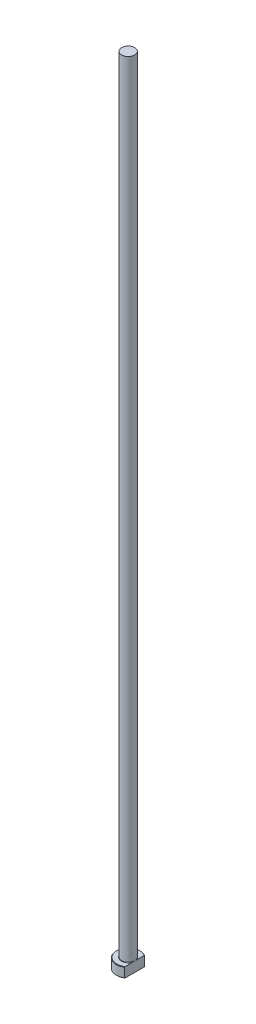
ISO-10303-21;
HEADER;
FILE_DESCRIPTION(('STEP AP214'),'2;1');
FILE_NAME('part.step','',(''),(''),'','','');
FILE_SCHEMA(('AUTOMOTIVE_DESIGN { 1 0 10303 214 1 1 1 1 }'));
ENDSEC;
DATA;
#1=APPLICATION_CONTEXT('core data for automotive mechanical design processes');
#2=APPLICATION_PROTOCOL_DEFINITION('international standard','automotive_design',2000,#1);
#3=PRODUCT_CONTEXT('',#1,'mechanical');
#4=PRODUCT('Part','Part','',(#3));
#5=PRODUCT_RELATED_PRODUCT_CATEGORY('part','',(#4));
#6=PRODUCT_DEFINITION_FORMATION('','',#4);
#7=PRODUCT_DEFINITION_CONTEXT('part definition',#1,'design');
#8=PRODUCT_DEFINITION('design','',#6,#7);
#9=PRODUCT_DEFINITION_SHAPE('','',#8);
#10=(LENGTH_UNIT() NAMED_UNIT(*) SI_UNIT(.MILLI.,.METRE.));
#11=(NAMED_UNIT(*) PLANE_ANGLE_UNIT() SI_UNIT($,.RADIAN.));
#12=(NAMED_UNIT(*) SI_UNIT($,.STERADIAN.) SOLID_ANGLE_UNIT());
#13=UNCERTAINTY_MEASURE_WITH_UNIT(LENGTH_MEASURE(1.E-05),#10,'distance_accuracy_value','');
#14=(GEOMETRIC_REPRESENTATION_CONTEXT(3) GLOBAL_UNCERTAINTY_ASSIGNED_CONTEXT((#13)) GLOBAL_UNIT_ASSIGNED_CONTEXT((#10,
#11,#12)) REPRESENTATION_CONTEXT('',''));
#15=CARTESIAN_POINT('',(0.,0.,0.));
#16=DIRECTION('',(0.,0.,1.));
#17=DIRECTION('',(1.,0.,0.));
#18=AXIS2_PLACEMENT_3D('',#15,#16,#17);
#19=CARTESIAN_POINT('',(0.,0.,0.));
#20=DIRECTION('',(0.,-1.,0.));
#21=DIRECTION('',(0.,0.,-1.));
#22=AXIS2_PLACEMENT_3D('',#19,#20,#21);
#23=PLANE('',#22);
#24=CARTESIAN_POINT('',(0.,0.,0.));
#25=DIRECTION('',(0.,-1.,0.));
#26=DIRECTION('',(0.,0.,-1.));
#27=AXIS2_PLACEMENT_3D('',#24,#25,#26);
#28=CIRCLE('',#27,5.79999999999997);
#29=CARTESIAN_POINT('',(3.24999999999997,0.,4.80390466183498));
#30=VERTEX_POINT('',#29);
#31=CARTESIAN_POINT('',(3.24999999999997,0.,-4.80390466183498));
#32=VERTEX_POINT('',#31);
#33=EDGE_CURVE('E98',#30,#32,#28,.T.);
#34=ORIENTED_EDGE('',*,*,#33,.T.);
#35=DIRECTION('',(0.,0.,1.));
#36=VECTOR('',#35,1.);
#37=CARTESIAN_POINT('',(3.24999999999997,0.,-5.04356025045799));
#38=LINE('',#37,#36);
#39=EDGE_CURVE('E83',#32,#30,#38,.T.);
#40=ORIENTED_EDGE('',*,*,#39,.T.);
#41=EDGE_LOOP('',(#34,#40));
#42=FACE_BOUND('',#41,.T.);
#43=ADVANCED_FACE('F32',(#42),#23,.T.);
#44=CARTESIAN_POINT('',(0.,259.958771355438,0.));
#45=DIRECTION('',(0.,1.,0.));
#46=DIRECTION('',(0.,0.,1.));
#47=AXIS2_PLACEMENT_3D('',#44,#45,#46);
#48=CYLINDRICAL_SURFACE('',#47,5.99999999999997);
#49=CARTESIAN_POINT('',(0.,4.80000000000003,0.));
#50=DIRECTION('',(0.,1.,0.));
#51=DIRECTION('',(0.,0.,1.));
#52=AXIS2_PLACEMENT_3D('',#49,#50,#51);
#53=CIRCLE('',#52,5.99999999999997);
#54=CARTESIAN_POINT('',(3.24999999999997,4.80000000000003,5.04356025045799));
#55=VERTEX_POINT('',#54);
#56=CARTESIAN_POINT('',(3.24999999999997,4.80000000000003,-5.04356025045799));
#57=VERTEX_POINT('',#56);
#58=EDGE_CURVE('E104',#55,#57,#53,.F.);
#59=ORIENTED_EDGE('',*,*,#58,.T.);
#60=DIRECTION('',(0.,-1.,0.));
#61=VECTOR('',#60,1.);
#62=CARTESIAN_POINT('',(3.24999999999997,400.,-5.04356025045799));
#63=LINE('',#62,#61);
#64=CARTESIAN_POINT('',(3.24999999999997,0.199999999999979,-5.04356025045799));
#65=VERTEX_POINT('',#64);
#66=EDGE_CURVE('E183',#57,#65,#63,.T.);
#67=ORIENTED_EDGE('',*,*,#66,.T.);
#68=CARTESIAN_POINT('',(0.,0.199999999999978,0.));
#69=DIRECTION('',(0.,-1.,0.));
#70=DIRECTION('',(0.,0.,-1.));
#71=AXIS2_PLACEMENT_3D('',#68,#69,#70);
#72=CIRCLE('',#71,5.99999999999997);
#73=CARTESIAN_POINT('',(3.24999999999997,0.199999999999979,5.04356025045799));
#74=VERTEX_POINT('',#73);
#75=EDGE_CURVE('E100',#65,#74,#72,.F.);
#76=ORIENTED_EDGE('',*,*,#75,.T.);
#77=DIRECTION('',(0.,-1.,0.));
#78=VECTOR('',#77,1.);
#79=CARTESIAN_POINT('',(3.24999999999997,400.,5.04356025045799));
#80=LINE('',#79,#78);
#81=EDGE_CURVE('E93',#55,#74,#80,.T.);
#82=ORIENTED_EDGE('',*,*,#81,.F.);
#83=EDGE_LOOP('',(#59,#67,#76,#82));
#84=FACE_BOUND('',#83,.T.);
#85=ADVANCED_FACE('F158',(#84),#48,.T.);
#86=CARTESIAN_POINT('',(-5.99999999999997,5.,0.));
#87=DIRECTION('',(0.,1.,0.));
#88=DIRECTION('',(0.,0.,1.));
#89=AXIS2_PLACEMENT_3D('',#86,#87,#88);
#90=PLANE('',#89);
#91=CARTESIAN_POINT('',(0.,5.,0.));
#92=DIRECTION('',(0.,1.,0.));
#93=DIRECTION('',(0.,0.,1.));
#94=AXIS2_PLACEMENT_3D('',#91,#92,#93);
#95=CIRCLE('',#94,5.79999999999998);
#96=CARTESIAN_POINT('',(3.24999999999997,5.,-4.80390466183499));
#97=VERTEX_POINT('',#96);
#98=CARTESIAN_POINT('',(3.24999999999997,5.,4.80390466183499));
#99=VERTEX_POINT('',#98);
#100=EDGE_CURVE('E178',#97,#99,#95,.T.);
#101=ORIENTED_EDGE('',*,*,#100,.T.);
#102=DIRECTION('',(0.,0.,-1.));
#103=VECTOR('',#102,1.);
#104=CARTESIAN_POINT('',(3.24999999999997,5.,0.));
#105=LINE('',#104,#103);
#106=CARTESIAN_POINT('',(3.24999999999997,4.99999999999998,1.15758369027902));
#107=VERTEX_POINT('',#106);
#108=EDGE_CURVE('E57',#99,#107,#105,.T.);
#109=ORIENTED_EDGE('',*,*,#108,.T.);
#110=CARTESIAN_POINT('',(0.,5.,0.));
#111=DIRECTION('',(0.,1.,0.));
#112=DIRECTION('',(0.,0.,1.));
#113=AXIS2_PLACEMENT_3D('',#110,#111,#112);
#114=CIRCLE('',#113,3.44999999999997);
#115=CARTESIAN_POINT('',(3.24999999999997,4.99999999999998,-1.15758369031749));
#116=VERTEX_POINT('',#115);
#117=EDGE_CURVE('E107',#107,#116,#114,.F.);
#118=ORIENTED_EDGE('',*,*,#117,.T.);
#119=EDGE_CURVE('E136',#116,#97,#105,.T.);
#120=ORIENTED_EDGE('',*,*,#119,.T.);
#121=EDGE_LOOP('',(#101,#109,#118,#120));
#122=FACE_BOUND('',#121,.T.);
#123=ADVANCED_FACE('F147',(#122),#90,.T.);
#124=CARTESIAN_POINT('',(0.,5.,0.));
#125=DIRECTION('',(0.,-1.,0.));
#126=DIRECTION('',(0.,0.,-1.));
#127=AXIS2_PLACEMENT_3D('',#124,#125,#126);
#128=CONICAL_SURFACE('',#127,5.79999999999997,0.785398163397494);
#129=ORIENTED_EDGE('',*,*,#58,.F.);
#130=CARTESIAN_POINT('',(3.24999999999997,-0.763340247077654,11.097222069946));
#131=CARTESIAN_POINT('',(3.24999999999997,-0.555249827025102,10.8803821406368));
#132=CARTESIAN_POINT('',(3.24999999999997,-0.347401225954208,10.6633095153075));
#133=CARTESIAN_POINT('',(3.24999999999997,0.0676973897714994,10.2285893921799));
#134=CARTESIAN_POINT('',(3.24999999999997,0.274947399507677,10.010941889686));
#135=CARTESIAN_POINT('',(3.24999999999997,0.68879015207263,9.5749031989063));
#136=CARTESIAN_POINT('',(3.24999999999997,0.895382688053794,9.35651181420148));
#137=CARTESIAN_POINT('',(3.24999999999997,1.30769007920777,8.91890298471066));
#138=CARTESIAN_POINT('',(3.24999999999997,1.51340493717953,8.69968554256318));
#139=CARTESIAN_POINT('',(3.24999999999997,1.92056067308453,8.26365159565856));
#140=CARTESIAN_POINT('',(3.24999999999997,2.1220182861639,8.04685072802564));
#141=CARTESIAN_POINT('',(3.24999999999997,2.52361432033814,7.61203089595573));
#142=CARTESIAN_POINT('',(3.24999999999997,2.72375274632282,7.39401193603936));
#143=CARTESIAN_POINT('',(3.24999999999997,3.1223203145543,6.95646589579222));
#144=CARTESIAN_POINT('',(3.24999999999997,3.32074966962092,6.73693900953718));
#145=CARTESIAN_POINT('',(3.24999999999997,3.71541049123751,6.2959206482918));
#146=CARTESIAN_POINT('',(3.24999999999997,3.91164199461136,6.07442920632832));
#147=CARTESIAN_POINT('',(3.24999999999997,4.26795525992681,5.66684646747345));
#148=CARTESIAN_POINT('',(3.24999999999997,4.42849662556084,5.48115751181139));
#149=CARTESIAN_POINT('',(3.24999999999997,4.74694681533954,5.10749706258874));
#150=CARTESIAN_POINT('',(3.24999999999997,4.9048553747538,4.91952534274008));
#151=CARTESIAN_POINT('',(3.24999999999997,5.21865243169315,4.53879767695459));
#152=CARTESIAN_POINT('',(3.24999999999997,5.37450606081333,4.34601291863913));
#153=CARTESIAN_POINT('',(3.24999999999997,5.68118935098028,3.95653844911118));
#154=CARTESIAN_POINT('',(3.24999999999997,5.83202036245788,3.75984981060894));
#155=CARTESIAN_POINT('',(3.24999999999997,6.05390638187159,3.4594085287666));
#156=CARTESIAN_POINT('',(3.24999999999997,6.12763821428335,3.35763377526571));
#157=CARTESIAN_POINT('',(3.24999999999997,6.27282302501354,3.15247478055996));
#158=CARTESIAN_POINT('',(3.24999999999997,6.3442761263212,3.04909062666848));
#159=CARTESIAN_POINT('',(3.24999999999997,6.48448981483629,2.84026816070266));
#160=CARTESIAN_POINT('',(3.24999999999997,6.55324599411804,2.7348268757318));
#161=CARTESIAN_POINT('',(3.24999999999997,6.68723865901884,2.52174014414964));
#162=CARTESIAN_POINT('',(3.24999999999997,6.75247550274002,2.4140949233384));
#163=CARTESIAN_POINT('',(3.24999999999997,6.87780644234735,2.19745654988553));
#164=CARTESIAN_POINT('',(3.24999999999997,6.93795082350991,2.08849289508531));
#165=CARTESIAN_POINT('',(3.24999999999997,7.05273719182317,1.86772106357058));
#166=CARTESIAN_POINT('',(3.24999999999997,7.10737807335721,1.75591232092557));
#167=CARTESIAN_POINT('',(3.24999999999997,7.26056715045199,1.41626442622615));
#168=CARTESIAN_POINT('',(3.24999999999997,7.34888232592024,1.1833811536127));
#169=CARTESIAN_POINT('',(3.24999999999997,7.44593218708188,0.835575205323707));
#170=CARTESIAN_POINT('',(3.24999999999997,7.4718222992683,0.725406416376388));
#171=CARTESIAN_POINT('',(3.24999999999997,7.51310579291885,0.5030789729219));
#172=CARTESIAN_POINT('',(3.24999999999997,7.52850034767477,0.390920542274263));
#173=CARTESIAN_POINT('',(3.24999999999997,7.54767882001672,0.166070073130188));
#174=CARTESIAN_POINT('',(3.24999999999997,7.5515109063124,0.0533822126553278));
#175=CARTESIAN_POINT('',(3.24999999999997,7.54741082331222,-0.171782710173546));
#176=CARTESIAN_POINT('',(3.24999999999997,7.5394779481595,-0.28425975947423));
#177=CARTESIAN_POINT('',(3.24999999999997,7.51253523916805,-0.507025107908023));
#178=CARTESIAN_POINT('',(3.24999999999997,7.4936058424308,-0.617323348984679));
#179=CARTESIAN_POINT('',(3.24999999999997,7.44595440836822,-0.835762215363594));
#180=CARTESIAN_POINT('',(3.24999999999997,7.41723093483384,-0.943902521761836));
#181=CARTESIAN_POINT('',(3.24999999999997,7.35127840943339,-1.15830231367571));
#182=CARTESIAN_POINT('',(3.24999999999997,7.31399439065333,-1.26454464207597));
#183=CARTESIAN_POINT('',(3.24999999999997,7.23254630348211,-1.47430332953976));
#184=CARTESIAN_POINT('',(3.24999999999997,7.18838353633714,-1.57782019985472));
#185=CARTESIAN_POINT('',(3.24999999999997,7.09672451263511,-1.7774238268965));
#186=CARTESIAN_POINT('',(3.24999999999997,7.04948595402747,-1.87363004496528));
#187=CARTESIAN_POINT('',(3.24999999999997,6.95089019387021,-2.06391775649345));
#188=CARTESIAN_POINT('',(3.24999999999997,6.89953216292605,-2.15799881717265));
#189=CARTESIAN_POINT('',(3.24999999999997,6.74036914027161,-2.43755985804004));
#190=CARTESIAN_POINT('',(3.24999999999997,6.62755752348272,-2.62018561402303));
#191=CARTESIAN_POINT('',(3.24999999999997,6.39256809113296,-2.98019331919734));
#192=CARTESIAN_POINT('',(3.24999999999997,6.27035601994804,-3.15755247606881));
#193=CARTESIAN_POINT('',(3.24999999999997,6.0197011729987,-3.50765833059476));
#194=CARTESIAN_POINT('',(3.24999999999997,5.8912614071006,-3.68040719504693));
#195=CARTESIAN_POINT('',(3.24999999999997,5.62829316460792,-4.02448614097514));
#196=CARTESIAN_POINT('',(3.24999999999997,5.49371006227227,-4.19577421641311));
#197=CARTESIAN_POINT('',(3.24999999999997,5.22110967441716,-4.5356145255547));
#198=CARTESIAN_POINT('',(3.24999999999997,5.08309204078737,-4.70416647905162));
#199=CARTESIAN_POINT('',(3.24999999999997,4.80478673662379,-5.03871726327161));
#200=CARTESIAN_POINT('',(3.24999999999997,4.66450509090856,-5.20472111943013));
#201=CARTESIAN_POINT('',(3.24999999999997,4.38193422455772,-5.53501285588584));
#202=CARTESIAN_POINT('',(3.24999999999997,4.23964496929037,-5.69930070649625));
#203=CARTESIAN_POINT('',(3.24999999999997,3.89726045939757,-6.09077577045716));
#204=CARTESIAN_POINT('',(3.24999999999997,3.69642117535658,-6.31731165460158));
#205=CARTESIAN_POINT('',(3.24999999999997,3.29246897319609,-6.76834962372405));
#206=CARTESIAN_POINT('',(3.24999999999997,3.08935601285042,-6.99285167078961));
#207=CARTESIAN_POINT('',(3.24999999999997,2.68122553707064,-7.44046009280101));
#208=CARTESIAN_POINT('',(3.24999999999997,2.47620657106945,-7.66356514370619));
#209=CARTESIAN_POINT('',(3.24999999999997,2.06481442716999,-8.10852300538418));
#210=CARTESIAN_POINT('',(3.24999999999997,1.85844124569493,-8.33037581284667));
#211=CARTESIAN_POINT('',(3.24999999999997,1.45176082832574,-8.76543407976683));
#212=CARTESIAN_POINT('',(3.24999999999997,1.25149010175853,-8.9786736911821));
#213=CARTESIAN_POINT('',(3.24999999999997,0.850131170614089,-9.40438299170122));
#214=CARTESIAN_POINT('',(3.24999999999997,0.649042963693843,-9.61685267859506));
#215=CARTESIAN_POINT('',(3.24999999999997,0.246391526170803,-10.0409455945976));
#216=CARTESIAN_POINT('',(3.24999999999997,0.0448289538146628,-10.2525694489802));
#217=CARTESIAN_POINT('',(3.24999999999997,-0.358859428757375,-10.6752763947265));
#218=CARTESIAN_POINT('',(3.24999999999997,-0.560985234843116,-10.8863594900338));
#219=CARTESIAN_POINT('',(3.24999999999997,-0.763340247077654,-11.097222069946));
#220=B_SPLINE_CURVE_WITH_KNOTS('',3,(#130,#131,#132,#133,#134,#135,#136,#137,#138,#139,#140,
#141,#142,#143,#144,#145,#146,#147,#148,#149,#150,#151,#152,#153,#154,#155,#156,#157,#158,#159,
#160,#161,#162,#163,#164,#165,#166,#167,#168,#169,#170,#171,#172,#173,#174,#175,#176,#177,#178,
#179,#180,#181,#182,#183,#184,#185,#186,#187,#188,#189,#190,#191,#192,#193,#194,#195,#196,#197,
#198,#199,#200,#201,#202,#203,#204,#205,#206,#207,#208,#209,#210,#211,#212,#213,#214,#215,#216,
#217,#218,#219),.UNSPECIFIED.,.F.,.F.,(4,2,2,2,2,2,2,2,2,2,2,2,2,2,2,2,2,2,2,2,2,2,2,2,2,2,2,2,
2,2,2,2,2,2,2,2,2,2,2,2,2,2,2,2,4),(0.,0.901604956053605,1.80321729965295,2.70508973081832,
3.60695928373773,4.49481204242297,5.3826615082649,6.27039876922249,7.15812113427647,
7.89450333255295,8.63095913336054,9.37461869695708,10.1180766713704,10.4950808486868,
10.8720646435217,11.2496408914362,11.6271786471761,12.0003984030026,12.3736929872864,
13.117405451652,13.4565058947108,13.795568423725,14.1332164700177,14.4708847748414,
14.8061136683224,15.1413917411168,15.4788860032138,15.8163164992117,16.1377318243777,
16.4592120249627,17.1027431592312,17.7487418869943,18.3944314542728,19.0478814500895,
19.7013979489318,20.3533948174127,21.0054029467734,21.9136176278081,22.8218492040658,
23.7308402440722,24.6398336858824,25.5174503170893,26.3950694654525,27.2718289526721,
28.1485820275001),.UNSPECIFIED.);
#221=EDGE_CURVE('E135',#55,#99,#220,.T.);
#222=ORIENTED_EDGE('',*,*,#221,.T.);
#223=ORIENTED_EDGE('',*,*,#100,.F.);
#224=EDGE_CURVE('E127',#97,#57,#220,.T.);
#225=ORIENTED_EDGE('',*,*,#224,.T.);
#226=EDGE_LOOP('',(#129,#222,#223,#225));
#227=FACE_BOUND('',#226,.T.);
#228=ADVANCED_FACE('F143',(#227),#128,.T.);
#229=CARTESIAN_POINT('',(0.,0.199999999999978,0.));
#230=DIRECTION('',(0.,1.,0.));
#231=DIRECTION('',(0.,0.,1.));
#232=AXIS2_PLACEMENT_3D('',#229,#230,#231);
#233=CONICAL_SURFACE('',#232,5.99999999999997,0.785398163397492);
#234=ORIENTED_EDGE('',*,*,#75,.F.);
#235=CARTESIAN_POINT('',(3.24999999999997,5.76334024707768,-11.097222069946));
#236=CARTESIAN_POINT('',(3.24999999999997,5.55524982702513,-10.8803821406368));
#237=CARTESIAN_POINT('',(3.24999999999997,5.34740122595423,-10.6633095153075));
#238=CARTESIAN_POINT('',(3.24999999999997,4.93230261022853,-10.2285893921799));
#239=CARTESIAN_POINT('',(3.24999999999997,4.72505260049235,-10.010941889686));
#240=CARTESIAN_POINT('',(3.24999999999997,4.31120984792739,-9.5749031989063));
#241=CARTESIAN_POINT('',(3.24999999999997,4.10461731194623,-9.35651181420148));
#242=CARTESIAN_POINT('',(3.24999999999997,3.69230992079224,-8.91890298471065));
#243=CARTESIAN_POINT('',(3.24999999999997,3.48659506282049,-8.69968554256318));
#244=CARTESIAN_POINT('',(3.24999999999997,3.07943932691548,-8.26365159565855));
#245=CARTESIAN_POINT('',(3.24999999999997,2.87798171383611,-8.04685072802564));
#246=CARTESIAN_POINT('',(3.24999999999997,2.47638567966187,-7.61203089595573));
#247=CARTESIAN_POINT('',(3.24999999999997,2.27624725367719,-7.39401193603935));
#248=CARTESIAN_POINT('',(3.24999999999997,1.87767968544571,-6.95646589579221));
#249=CARTESIAN_POINT('',(3.24999999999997,1.67925033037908,-6.73693900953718));
#250=CARTESIAN_POINT('',(3.24999999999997,1.28458950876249,-6.29592064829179));
#251=CARTESIAN_POINT('',(3.24999999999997,1.08835800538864,-6.07442920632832));
#252=CARTESIAN_POINT('',(3.24999999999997,0.732044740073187,-5.66684646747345));
#253=CARTESIAN_POINT('',(3.24999999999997,0.571503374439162,-5.48115751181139));
#254=CARTESIAN_POINT('',(3.24999999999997,0.25305318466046,-5.10749706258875));
#255=CARTESIAN_POINT('',(3.24999999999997,0.0951446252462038,-4.91952534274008));
#256=CARTESIAN_POINT('',(3.24999999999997,-0.218652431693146,-4.5387976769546));
#257=CARTESIAN_POINT('',(3.24999999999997,-0.374506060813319,-4.34601291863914));
#258=CARTESIAN_POINT('',(3.24999999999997,-0.681189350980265,-3.9565384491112));
#259=CARTESIAN_POINT('',(3.24999999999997,-0.832020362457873,-3.75984981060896));
#260=CARTESIAN_POINT('',(3.24999999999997,-1.05390638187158,-3.45940852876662));
#261=CARTESIAN_POINT('',(3.24999999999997,-1.12763821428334,-3.35763377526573));
#262=CARTESIAN_POINT('',(3.24999999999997,-1.27282302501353,-3.15247478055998));
#263=CARTESIAN_POINT('',(3.24999999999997,-1.34427612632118,-3.04909062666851));
#264=CARTESIAN_POINT('',(3.24999999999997,-1.48448981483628,-2.84026816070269));
#265=CARTESIAN_POINT('',(3.24999999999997,-1.55324599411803,-2.73482687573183));
#266=CARTESIAN_POINT('',(3.24999999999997,-1.68723865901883,-2.52174014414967));
#267=CARTESIAN_POINT('',(3.24999999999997,-1.75247550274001,-2.41409492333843));
#268=CARTESIAN_POINT('',(3.24999999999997,-1.87780644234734,-2.19745654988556));
#269=CARTESIAN_POINT('',(3.24999999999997,-1.93795082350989,-2.08849289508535));
#270=CARTESIAN_POINT('',(3.24999999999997,-2.05273719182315,-1.86772106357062));
#271=CARTESIAN_POINT('',(3.24999999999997,-2.10737807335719,-1.75591232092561));
#272=CARTESIAN_POINT('',(3.24999999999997,-2.26056715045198,-1.4162644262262));
#273=CARTESIAN_POINT('',(3.24999999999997,-2.34888232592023,-1.18338115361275));
#274=CARTESIAN_POINT('',(3.24999999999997,-2.44593218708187,-0.83557520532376));
#275=CARTESIAN_POINT('',(3.24999999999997,-2.4718222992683,-0.725406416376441));
#276=CARTESIAN_POINT('',(3.24999999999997,-2.51310579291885,-0.503078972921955));
#277=CARTESIAN_POINT('',(3.24999999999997,-2.52850034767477,-0.390920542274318));
#278=CARTESIAN_POINT('',(3.24999999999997,-2.54767882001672,-0.166070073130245));
#279=CARTESIAN_POINT('',(3.24999999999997,-2.5515109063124,-0.0533822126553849));
#280=CARTESIAN_POINT('',(3.24999999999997,-2.54741082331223,0.171782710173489));
#281=CARTESIAN_POINT('',(3.24999999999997,-2.53947794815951,0.284259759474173));
#282=CARTESIAN_POINT('',(3.24999999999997,-2.51253523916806,0.507025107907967));
#283=CARTESIAN_POINT('',(3.24999999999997,-2.49360584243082,0.617323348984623));
#284=CARTESIAN_POINT('',(3.24999999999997,-2.44595440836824,0.83576221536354));
#285=CARTESIAN_POINT('',(3.24999999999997,-2.41723093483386,0.943902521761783));
#286=CARTESIAN_POINT('',(3.24999999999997,-2.35127840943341,1.15830231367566));
#287=CARTESIAN_POINT('',(3.24999999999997,-2.31399439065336,1.26454464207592));
#288=CARTESIAN_POINT('',(3.24999999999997,-2.23254630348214,1.47430332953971));
#289=CARTESIAN_POINT('',(3.24999999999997,-2.18838353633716,1.57782019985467));
#290=CARTESIAN_POINT('',(3.24999999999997,-2.09672451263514,1.77742382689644));
#291=CARTESIAN_POINT('',(3.24999999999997,-2.04948595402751,1.87363004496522));
#292=CARTESIAN_POINT('',(3.24999999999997,-1.95089019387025,2.06391775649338));
#293=CARTESIAN_POINT('',(3.24999999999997,-1.8995321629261,2.15799881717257));
#294=CARTESIAN_POINT('',(3.24999999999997,-1.74036914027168,2.43755985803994));
#295=CARTESIAN_POINT('',(3.24999999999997,-1.6275575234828,2.62018561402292));
#296=CARTESIAN_POINT('',(3.24999999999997,-1.39256809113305,2.98019331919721));
#297=CARTESIAN_POINT('',(3.24999999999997,-1.27035601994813,3.15755247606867));
#298=CARTESIAN_POINT('',(3.24999999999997,-1.01970117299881,3.5076583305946));
#299=CARTESIAN_POINT('',(3.24999999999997,-0.891261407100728,3.68040719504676));
#300=CARTESIAN_POINT('',(3.24999999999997,-0.628293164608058,4.02448614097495));
#301=CARTESIAN_POINT('',(3.24999999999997,-0.493710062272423,4.19577421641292));
#302=CARTESIAN_POINT('',(3.24999999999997,-0.221109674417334,4.53561452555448));
#303=CARTESIAN_POINT('',(3.24999999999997,-0.0830920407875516,4.7041664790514));
#304=CARTESIAN_POINT('',(3.24999999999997,0.195213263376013,5.03871726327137));
#305=CARTESIAN_POINT('',(3.24999999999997,0.335494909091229,5.20472111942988));
#306=CARTESIAN_POINT('',(3.24999999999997,0.618065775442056,5.53501285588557));
#307=CARTESIAN_POINT('',(3.24999999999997,0.760355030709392,5.69930070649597));
#308=CARTESIAN_POINT('',(3.24999999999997,1.10273954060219,6.09077577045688));
#309=CARTESIAN_POINT('',(3.24999999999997,1.30357882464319,6.31731165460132));
#310=CARTESIAN_POINT('',(3.24999999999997,1.70753102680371,6.76834962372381));
#311=CARTESIAN_POINT('',(3.24999999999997,1.91064398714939,6.99285167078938));
#312=CARTESIAN_POINT('',(3.24999999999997,2.3187744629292,7.44046009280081));
#313=CARTESIAN_POINT('',(3.24999999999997,2.52379342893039,7.66356514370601));
#314=CARTESIAN_POINT('',(3.24999999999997,2.93518557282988,8.10852300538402));
#315=CARTESIAN_POINT('',(3.24999999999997,3.14155875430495,8.33037581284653));
#316=CARTESIAN_POINT('',(3.24999999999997,3.54823917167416,8.7654340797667));
#317=CARTESIAN_POINT('',(3.24999999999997,3.74850989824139,8.97867369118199));
#318=CARTESIAN_POINT('',(3.24999999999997,4.14986882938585,9.40438299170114));
#319=CARTESIAN_POINT('',(3.24999999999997,4.3509570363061,9.61685267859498));
#320=CARTESIAN_POINT('',(3.24999999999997,4.75360847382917,10.0409455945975));
#321=CARTESIAN_POINT('',(3.24999999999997,4.95517104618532,10.2525694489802));
#322=CARTESIAN_POINT('',(3.24999999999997,5.35885942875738,10.6752763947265));
#323=CARTESIAN_POINT('',(3.24999999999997,5.56098523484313,10.8863594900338));
#324=CARTESIAN_POINT('',(3.24999999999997,5.76334024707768,11.097222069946));
#325=B_SPLINE_CURVE_WITH_KNOTS('',3,(#235,#236,#237,#238,#239,#240,#241,#242,#243,#244,#245,
#246,#247,#248,#249,#250,#251,#252,#253,#254,#255,#256,#257,#258,#259,#260,#261,#262,#263,#264,
#265,#266,#267,#268,#269,#270,#271,#272,#273,#274,#275,#276,#277,#278,#279,#280,#281,#282,#283,
#284,#285,#286,#287,#288,#289,#290,#291,#292,#293,#294,#295,#296,#297,#298,#299,#300,#301,#302,
#303,#304,#305,#306,#307,#308,#309,#310,#311,#312,#313,#314,#315,#316,#317,#318,#319,#320,#321,
#322,#323,#324),.UNSPECIFIED.,.F.,.F.,(4,2,2,2,2,2,2,2,2,2,2,2,2,2,2,2,2,2,2,2,2,2,2,2,2,2,2,2,
2,2,2,2,2,2,2,2,2,2,2,2,2,2,2,2,4),(0.,0.901604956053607,1.80321729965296,2.70508973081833,
3.60695928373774,4.49481204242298,5.38266150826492,6.27039876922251,7.15812113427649,
7.89450333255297,8.63095913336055,9.37461869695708,10.1180766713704,10.4950808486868,
10.8720646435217,11.2496408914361,11.6271786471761,12.0003984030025,12.3736929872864,
13.117405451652,13.4565058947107,13.795568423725,14.1332164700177,14.4708847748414,
14.8061136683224,15.1413917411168,15.4788860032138,15.8163164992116,16.1377318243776,
16.4592120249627,17.1027431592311,17.7487418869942,18.3944314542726,19.0478814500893,
19.7013979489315,20.3533948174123,21.0054029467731,21.9136176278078,22.8218492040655,
23.730840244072,24.6398336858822,25.5174503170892,26.3950694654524,27.2718289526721,
28.1485820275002),.UNSPECIFIED.);
#326=EDGE_CURVE('E86',#65,#32,#325,.T.);
#327=ORIENTED_EDGE('',*,*,#326,.T.);
#328=ORIENTED_EDGE('',*,*,#33,.F.);
#329=EDGE_CURVE('E89',#30,#74,#325,.T.);
#330=ORIENTED_EDGE('',*,*,#329,.T.);
#331=EDGE_LOOP('',(#234,#327,#328,#330));
#332=FACE_BOUND('',#331,.T.);
#333=ADVANCED_FACE('F97',(#332),#233,.T.);
#334=CARTESIAN_POINT('',(0.,5.19999999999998,0.));
#335=DIRECTION('',(0.,1.,0.));
#336=DIRECTION('',(0.,0.,1.));
#337=AXIS2_PLACEMENT_3D('',#334,#335,#336);
#338=TOROIDAL_SURFACE('',#337,3.44999999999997,0.2);
#339=CARTESIAN_POINT('',(3.24999999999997,5.19999999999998,0.));
#340=CARTESIAN_POINT('',(3.24999999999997,5.20000050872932,1.30593484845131E-10));
#341=CARTESIAN_POINT('',(3.24999999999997,5.20000101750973,-2.02989018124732E-07));
#342=CARTESIAN_POINT('',(3.24999999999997,5.20000196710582,-7.62846146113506E-07));
#343=CARTESIAN_POINT('',(3.24999999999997,5.20000239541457,-1.13332165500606E-06));
#344=CARTESIAN_POINT('',(3.24999999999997,5.20000328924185,-2.02149564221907E-06));
#345=CARTESIAN_POINT('',(3.24999999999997,5.20000374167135,-2.55359112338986E-06));
#346=CARTESIAN_POINT('',(3.24999999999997,5.20000454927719,-3.65434903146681E-06));
#347=CARTESIAN_POINT('',(3.24999999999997,5.20000490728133,-4.22110424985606E-06));
#348=CARTESIAN_POINT('',(3.24999999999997,5.20000624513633,-6.42540895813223E-06));
#349=CARTESIAN_POINT('',(3.24999999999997,5.20000715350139,-8.1091236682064E-06));
#350=CARTESIAN_POINT('',(3.24999999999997,5.20000863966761,-1.14364149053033E-05));
#351=CARTESIAN_POINT('',(3.24999999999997,5.20000923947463,-1.30705587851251E-05));
#352=CARTESIAN_POINT('',(3.24999999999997,5.20001177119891,-2.00139280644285E-05));
#353=CARTESIAN_POINT('',(3.24999999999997,5.20001367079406,-2.53379428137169E-05));
#354=CARTESIAN_POINT('',(3.24999999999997,5.20001645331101,-3.53765138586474E-05));
#355=CARTESIAN_POINT('',(3.24999999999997,5.20001744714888,-4.00600779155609E-05));
#356=CARTESIAN_POINT('',(3.24999999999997,5.20002471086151,-7.49504389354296E-05));
#357=CARTESIAN_POINT('',(3.24999999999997,5.20003024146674,-0.00010526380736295));
#358=CARTESIAN_POINT('',(3.24999999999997,5.20005445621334,-0.00022532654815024));
#359=CARTESIAN_POINT('',(3.24999999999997,5.20007753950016,-0.000314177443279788));
#360=CARTESIAN_POINT('',(3.24999999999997,5.20016768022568,-0.000666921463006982));
#361=CARTESIAN_POINT('',(3.24999999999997,5.20023191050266,-0.000931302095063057));
#362=CARTESIAN_POINT('',(3.24999999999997,5.20048969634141,-0.00198463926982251));
#363=CARTESIAN_POINT('',(3.24999999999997,5.20068683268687,-0.0027729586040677));
#364=CARTESIAN_POINT('',(3.24999999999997,5.20150726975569,-0.00606245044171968));
#365=CARTESIAN_POINT('',(3.24999999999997,5.20212605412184,-0.00856442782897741));
#366=CARTESIAN_POINT('',(3.24999999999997,5.20719838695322,-0.0290628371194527));
#367=CARTESIAN_POINT('',(3.24999999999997,5.21166800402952,-0.0470565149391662));
#368=CARTESIAN_POINT('',(3.24999999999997,5.22040162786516,-0.0823313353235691));
#369=CARTESIAN_POINT('',(3.24999999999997,5.22466671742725,-0.0996122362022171));
#370=CARTESIAN_POINT('',(3.24999999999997,5.23855308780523,-0.156076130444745));
#371=CARTESIAN_POINT('',(3.24999999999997,5.24811538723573,-0.195273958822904));
#372=CARTESIAN_POINT('',(3.24999999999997,5.26421029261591,-0.262424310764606));
#373=CARTESIAN_POINT('',(3.24999999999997,5.27082096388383,-0.290358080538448));
#374=CARTESIAN_POINT('',(3.24999999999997,5.28365202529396,-0.345539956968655));
#375=CARTESIAN_POINT('',(3.24999999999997,5.28987810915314,-0.3727867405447));
#376=CARTESIAN_POINT('',(3.24999999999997,5.30721519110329,-0.45039737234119));
#377=CARTESIAN_POINT('',(3.24999999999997,5.31800675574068,-0.500833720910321));
#378=CARTESIAN_POINT('',(3.24999999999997,5.33836987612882,-0.60242326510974));
#379=CARTESIAN_POINT('',(3.24999999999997,5.34792968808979,-0.653578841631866));
#380=CARTESIAN_POINT('',(3.24999999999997,5.36597954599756,-0.760718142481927));
#381=CARTESIAN_POINT('',(3.24999999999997,5.37430170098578,-0.81673101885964));
#382=CARTESIAN_POINT('',(3.24999999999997,5.38793579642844,-0.928977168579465));
#383=CARTESIAN_POINT('',(3.24999999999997,5.39325594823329,-0.985209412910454));
#384=CARTESIAN_POINT('',(3.24999999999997,5.39967715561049,-1.09627192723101));
#385=CARTESIAN_POINT('',(3.24999999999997,5.40090002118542,-1.15109363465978));
#386=CARTESIAN_POINT('',(3.24999999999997,5.39854105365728,-1.23278196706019));
#387=CARTESIAN_POINT('',(3.24999999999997,5.397083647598,-1.25970835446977));
#388=CARTESIAN_POINT('',(3.24999999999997,5.39248016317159,-1.31340846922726));
#389=CARTESIAN_POINT('',(3.24999999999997,5.38933527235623,-1.34018229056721));
#390=CARTESIAN_POINT('',(3.24999999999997,5.38085808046,-1.39365539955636));
#391=CARTESIAN_POINT('',(3.24999999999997,5.37550486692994,-1.42035144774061));
#392=CARTESIAN_POINT('',(3.24999999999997,5.36186683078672,-1.47304562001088));
#393=CARTESIAN_POINT('',(3.24999999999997,5.35358306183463,-1.49904399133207));
#394=CARTESIAN_POINT('',(3.24999999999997,5.33840624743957,-1.53566403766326));
#395=CARTESIAN_POINT('',(3.24999999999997,5.33319528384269,-1.54697847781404));
#396=CARTESIAN_POINT('',(3.24999999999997,5.32165705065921,-1.56904809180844));
#397=CARTESIAN_POINT('',(3.24999999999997,5.31532920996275,-1.57980297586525));
#398=CARTESIAN_POINT('',(3.24999999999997,5.30232638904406,-1.5988624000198));
#399=CARTESIAN_POINT('',(3.24999999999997,5.2958406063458,-1.60729427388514));
#400=CARTESIAN_POINT('',(3.24999999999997,5.28165581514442,-1.62307272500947));
#401=CARTESIAN_POINT('',(3.24999999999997,5.2739607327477,-1.63042267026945));
#402=CARTESIAN_POINT('',(3.24999999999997,5.26066720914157,-1.64067803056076));
#403=CARTESIAN_POINT('',(3.24999999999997,5.25551950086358,-1.64416379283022));
#404=CARTESIAN_POINT('',(3.24999999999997,5.24475577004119,-1.65032852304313));
#405=CARTESIAN_POINT('',(3.24999999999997,5.23914006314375,-1.65300802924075));
#406=CARTESIAN_POINT('',(3.24999999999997,5.22744494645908,-1.65736207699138));
#407=CARTESIAN_POINT('',(3.24999999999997,5.22136079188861,-1.65902420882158));
#408=CARTESIAN_POINT('',(3.24999999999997,5.20898349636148,-1.66109219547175));
#409=CARTESIAN_POINT('',(3.24999999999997,5.20269065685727,-1.66149978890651));
#410=CARTESIAN_POINT('',(3.24999999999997,5.19107570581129,-1.66104520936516));
#411=CARTESIAN_POINT('',(3.24999999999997,5.18574582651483,-1.66035949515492));
#412=CARTESIAN_POINT('',(3.24999999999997,5.17527668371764,-1.65810570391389));
#413=CARTESIAN_POINT('',(3.24999999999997,5.1701375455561,-1.65653705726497));
#414=CARTESIAN_POINT('',(3.24999999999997,5.15872192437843,-1.65208432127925));
#415=CARTESIAN_POINT('',(3.24999999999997,5.15254320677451,-1.64895170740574));
#416=CARTESIAN_POINT('',(3.24999999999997,5.14076776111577,-1.64173915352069));
#417=CARTESIAN_POINT('',(3.24999999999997,5.13517231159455,-1.63765719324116));
#418=CARTESIAN_POINT('',(3.24999999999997,5.12145239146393,-1.62621801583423));
#419=CARTESIAN_POINT('',(3.24999999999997,5.11376432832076,-1.61834208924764));
#420=CARTESIAN_POINT('',(3.24999999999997,5.09963913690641,-1.6015591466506));
#421=CARTESIAN_POINT('',(3.24999999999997,5.0932043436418,-1.59265025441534));
#422=CARTESIAN_POINT('',(3.24999999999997,5.07579513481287,-1.56554611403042));
#423=CARTESIAN_POINT('',(3.24999999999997,5.06621235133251,-1.54646705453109));
#424=CARTESIAN_POINT('',(3.24999999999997,5.04964498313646,-1.5071324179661));
#425=CARTESIAN_POINT('',(3.24999999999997,5.04268052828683,-1.48686905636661));
#426=CARTESIAN_POINT('',(3.24999999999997,5.02812767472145,-1.43684519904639));
#427=CARTESIAN_POINT('',(3.24999999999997,5.02158372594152,-1.40678481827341));
#428=CARTESIAN_POINT('',(3.24999999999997,5.01134780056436,-1.3461374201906));
#429=CARTESIAN_POINT('',(3.24999999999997,5.00766434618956,-1.31554910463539));
#430=CARTESIAN_POINT('',(3.24999999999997,5.00256038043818,-1.2550900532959));
#431=CARTESIAN_POINT('',(3.24999999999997,5.00107707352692,-1.22522437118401));
#432=CARTESIAN_POINT('',(3.24999999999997,4.99975288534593,-1.16560651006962));
#433=CARTESIAN_POINT('',(3.24999999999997,4.99990422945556,-1.13585446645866));
#434=CARTESIAN_POINT('',(3.24999999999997,5.00180470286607,-1.06636643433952));
#435=CARTESIAN_POINT('',(3.24999999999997,5.00407520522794,-1.02664548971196));
#436=CARTESIAN_POINT('',(3.24999999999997,5.01046283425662,-0.947373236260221));
#437=CARTESIAN_POINT('',(3.24999999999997,5.01457941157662,-0.907821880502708));
#438=CARTESIAN_POINT('',(3.24999999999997,5.02439538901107,-0.827971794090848));
#439=CARTESIAN_POINT('',(3.24999999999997,5.03012984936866,-0.787677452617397));
#440=CARTESIAN_POINT('',(3.24999999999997,5.0428354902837,-0.707180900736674));
#441=CARTESIAN_POINT('',(3.24999999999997,5.04980982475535,-0.666979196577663));
#442=CARTESIAN_POINT('',(3.24999999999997,5.06745383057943,-0.572058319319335));
#443=CARTESIAN_POINT('',(3.24999999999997,5.07854113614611,-0.517417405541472));
#444=CARTESIAN_POINT('',(3.24999999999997,5.10182947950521,-0.409021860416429));
#445=CARTESIAN_POINT('',(3.24999999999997,5.11401657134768,-0.355264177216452));
#446=CARTESIAN_POINT('',(3.24999999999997,5.13769793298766,-0.254099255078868));
#447=CARTESIAN_POINT('',(3.24999999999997,5.14911069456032,-0.206672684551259));
#448=CARTESIAN_POINT('',(3.24999999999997,5.1727713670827,-0.109852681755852));
#449=CARTESIAN_POINT('',(3.24999999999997,5.18503405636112,-0.0604628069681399));
#450=CARTESIAN_POINT('',(3.24999999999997,5.19787537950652,-0.0085581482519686));
#451=CARTESIAN_POINT('',(3.24999999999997,5.19849580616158,-0.00604992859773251));
#452=CARTESIAN_POINT('',(3.24999999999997,5.19931662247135,-0.00275902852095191));
#453=CARTESIAN_POINT('',(3.24999999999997,5.19951254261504,-0.00197555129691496));
#454=CARTESIAN_POINT('',(3.24999999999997,5.1997688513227,-0.000928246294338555));
#455=CARTESIAN_POINT('',(3.24999999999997,5.19983279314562,-0.000665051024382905));
#456=CARTESIAN_POINT('',(3.24999999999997,5.19992258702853,-0.000313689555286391));
#457=CARTESIAN_POINT('',(3.24999999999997,5.19994562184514,-0.000225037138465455));
#458=CARTESIAN_POINT('',(3.24999999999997,5.19996979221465,-0.000105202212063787));
#459=CARTESIAN_POINT('',(3.24999999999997,5.19997531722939,-7.49162835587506E-05));
#460=CARTESIAN_POINT('',(3.24999999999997,5.19998256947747,-4.0053976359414E-05));
#461=CARTESIAN_POINT('',(3.24999999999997,5.1999835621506,-3.53718998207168E-05));
#462=CARTESIAN_POINT('',(3.24999999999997,5.19998634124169,-2.53364128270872E-05));
#463=CARTESIAN_POINT('',(3.24999999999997,5.19998823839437,-2.00139156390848E-05));
#464=CARTESIAN_POINT('',(3.24999999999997,5.19999076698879,-1.30721306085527E-05));
#465=CARTESIAN_POINT('',(3.24999999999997,5.19999136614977,-1.14380977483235E-05));
#466=CARTESIAN_POINT('',(3.24999999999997,5.19999285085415,-8.11092555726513E-06));
#467=CARTESIAN_POINT('',(3.24999999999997,5.19999375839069,-6.42720440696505E-06));
#468=CARTESIAN_POINT('',(3.24999999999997,5.19999509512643,-4.2227718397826E-06));
#469=CARTESIAN_POINT('',(3.24999999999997,5.1999954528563,-3.65594799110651E-06));
#470=CARTESIAN_POINT('',(3.24999999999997,5.19999625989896,-2.55500330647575E-06));
#471=CARTESIAN_POINT('',(3.24999999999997,5.19999671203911,-2.0227876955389E-06));
#472=CARTESIAN_POINT('',(3.24999999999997,5.19999760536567,-1.13433308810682E-06));
#473=CARTESIAN_POINT('',(3.24999999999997,5.19999803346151,-7.63708107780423E-07));
#474=CARTESIAN_POINT('',(3.24999999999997,5.19999898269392,-2.03470796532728E-07));
#475=CARTESIAN_POINT('',(3.24999999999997,5.19999949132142,-1.30580450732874E-10));
#476=CARTESIAN_POINT('',(3.24999999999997,5.19999999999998,0.));
#477=B_SPLINE_CURVE_WITH_KNOTS('',3,(#339,#340,#341,#342,#343,#344,#345,#346,#347,#348,#349,
#350,#351,#352,#353,#354,#355,#356,#357,#358,#359,#360,#361,#362,#363,#364,#365,#366,#367,#368,
#369,#370,#371,#372,#373,#374,#375,#376,#377,#378,#379,#380,#381,#382,#383,#384,#385,#386,#387,
#388,#389,#390,#391,#392,#393,#394,#395,#396,#397,#398,#399,#400,#401,#402,#403,#404,#405,#406,
#407,#408,#409,#410,#411,#412,#413,#414,#415,#416,#417,#418,#419,#420,#421,#422,#423,#424,#425,
#426,#427,#428,#429,#430,#431,#432,#433,#434,#435,#436,#437,#438,#439,#440,#441,#442,#443,#444,
#445,#446,#447,#448,#449,#450,#451,#452,#453,#454,#455,#456,#457,#458,#459,#460,#461,#462,#463,
#464,#465,#466,#467,#468,#469,#470,#471,#472,#473,#474,#475,#476),.UNSPECIFIED.,.T.,.F.,(4,2,2,
2,2,2,2,2,2,2,2,2,2,2,2,2,2,2,2,2,2,2,2,2,2,2,2,2,2,2,2,2,2,2,2,2,2,2,2,2,2,2,2,2,2,2,2,2,2,2,2,
2,2,2,2,2,2,2,2,2,2,2,2,2,2,2,2,2,4),(0.,1.54201220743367E-06,3.24382184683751E-06,
5.32610111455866E-06,7.33619204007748E-06,1.30552971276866E-05,1.82727733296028E-05,
3.52029744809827E-05,4.95493511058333E-05,0.000142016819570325,0.000417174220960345,
0.00123364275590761,0.00367111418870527,0.0114035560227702,0.0670234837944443,0.120422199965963,
0.241463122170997,0.327578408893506,0.411425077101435,0.566146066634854,0.722247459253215,
0.892069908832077,1.06142556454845,1.22569945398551,1.30655828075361,1.38736027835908,
1.46894569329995,1.55050180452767,1.58782892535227,1.62517518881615,1.65700740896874,
1.68873834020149,1.70733388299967,1.72591698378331,1.74472246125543,1.76350186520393,
1.77954337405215,1.79559524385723,1.81626176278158,1.83697267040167,1.86980451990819,
1.90269696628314,1.96639085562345,2.03056487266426,2.12263115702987,2.21497069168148,
2.30462030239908,2.39384371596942,2.51314182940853,2.632404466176,2.75448156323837,
2.8768737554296,3.04411391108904,3.20947099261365,3.35581134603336,3.50847473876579,
3.51622652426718,3.51864902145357,3.5194618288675,3.51973637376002,3.51982875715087,
3.51984309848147,3.51986002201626,3.51986523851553,3.5198709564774,3.51987296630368,
3.51987504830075,3.51987674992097,3.51987829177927),.UNSPECIFIED.);
#478=CARTESIAN_POINT('',(3.24999999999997,5.19999999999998,0.));
#479=VERTEX_POINT('',#478);
#480=EDGE_CURVE('E11',#116,#479,#477,.T.);
#481=ORIENTED_EDGE('',*,*,#480,.F.);
#482=ORIENTED_EDGE('',*,*,#117,.F.);
#483=CARTESIAN_POINT('',(3.24999999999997,5.19999999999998,0.));
#484=CARTESIAN_POINT('',(3.24999999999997,5.19999949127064,-1.30593493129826E-10));
#485=CARTESIAN_POINT('',(3.24999999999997,5.19999898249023,2.02989018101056E-07));
#486=CARTESIAN_POINT('',(3.24999999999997,5.19999803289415,7.62846146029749E-07));
#487=CARTESIAN_POINT('',(3.24999999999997,5.1999976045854,1.13332165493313E-06));
#488=CARTESIAN_POINT('',(3.24999999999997,5.19999671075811,2.02149564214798E-06));
#489=CARTESIAN_POINT('',(3.24999999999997,5.19999625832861,2.55359112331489E-06));
#490=CARTESIAN_POINT('',(3.24999999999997,5.19999545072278,3.65434903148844E-06));
#491=CARTESIAN_POINT('',(3.24999999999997,5.19999509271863,4.2211042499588E-06));
#492=CARTESIAN_POINT('',(3.24999999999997,5.19999375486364,6.4254089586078E-06));
#493=CARTESIAN_POINT('',(3.24999999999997,5.19999284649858,8.10912366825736E-06));
#494=CARTESIAN_POINT('',(3.24999999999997,5.19999136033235,1.14364149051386E-05));
#495=CARTESIAN_POINT('',(3.24999999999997,5.19999076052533,1.30705587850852E-05));
#496=CARTESIAN_POINT('',(3.24999999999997,5.19998822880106,2.00139280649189E-05));
#497=CARTESIAN_POINT('',(3.24999999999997,5.19998632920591,2.53379428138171E-05));
#498=CARTESIAN_POINT('',(3.24999999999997,5.19998354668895,3.53765138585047E-05));
#499=CARTESIAN_POINT('',(3.24999999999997,5.19998255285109,4.00600779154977E-05));
#500=CARTESIAN_POINT('',(3.24999999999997,5.19997528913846,7.4950438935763E-05));
#501=CARTESIAN_POINT('',(3.24999999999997,5.19996975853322,0.000105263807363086));
#502=CARTESIAN_POINT('',(3.24999999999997,5.19994554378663,0.000225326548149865));
#503=CARTESIAN_POINT('',(3.24999999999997,5.19992246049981,0.000314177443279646));
#504=CARTESIAN_POINT('',(3.24999999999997,5.19983231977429,0.000666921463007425));
#505=CARTESIAN_POINT('',(3.24999999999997,5.19976808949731,0.000931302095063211));
#506=CARTESIAN_POINT('',(3.24999999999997,5.19951030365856,0.00198463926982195));
#507=CARTESIAN_POINT('',(3.24999999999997,5.1993131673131,0.00277295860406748));
#508=CARTESIAN_POINT('',(3.24999999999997,5.19849273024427,0.00606245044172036));
#509=CARTESIAN_POINT('',(3.24999999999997,5.19787394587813,0.00856442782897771));
#510=CARTESIAN_POINT('',(3.24999999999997,5.19280161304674,0.0290628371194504));
#511=CARTESIAN_POINT('',(3.24999999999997,5.18833199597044,0.0470565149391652));
#512=CARTESIAN_POINT('',(3.24999999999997,5.1795983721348,0.082331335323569));
#513=CARTESIAN_POINT('',(3.24999999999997,5.17533328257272,0.0996122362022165));
#514=CARTESIAN_POINT('',(3.24999999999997,5.16144691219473,0.156076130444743));
#515=CARTESIAN_POINT('',(3.24999999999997,5.15188461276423,0.195273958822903));
#516=CARTESIAN_POINT('',(3.24999999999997,5.13578970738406,0.262424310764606));
#517=CARTESIAN_POINT('',(3.24999999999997,5.12917903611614,0.290358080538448));
#518=CARTESIAN_POINT('',(3.24999999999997,5.116347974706,0.345539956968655));
#519=CARTESIAN_POINT('',(3.24999999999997,5.11012189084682,0.3727867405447));
#520=CARTESIAN_POINT('',(3.24999999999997,5.09278480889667,0.45039737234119));
#521=CARTESIAN_POINT('',(3.24999999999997,5.08199324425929,0.500833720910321));
#522=CARTESIAN_POINT('',(3.24999999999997,5.06163012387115,0.60242326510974));
#523=CARTESIAN_POINT('',(3.24999999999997,5.05207031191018,0.653578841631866));
#524=CARTESIAN_POINT('',(3.24999999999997,5.03402045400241,0.760718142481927));
#525=CARTESIAN_POINT('',(3.24999999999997,5.02569829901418,0.81673101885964));
#526=CARTESIAN_POINT('',(3.24999999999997,5.01206420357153,0.928977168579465));
#527=CARTESIAN_POINT('',(3.24999999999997,5.00674405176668,0.985209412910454));
#528=CARTESIAN_POINT('',(3.24999999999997,5.00032284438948,1.09627192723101));
#529=CARTESIAN_POINT('',(3.24999999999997,4.99909997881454,1.15109363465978));
#530=CARTESIAN_POINT('',(3.24999999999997,5.00145894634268,1.23278196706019));
#531=CARTESIAN_POINT('',(3.24999999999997,5.00291635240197,1.25970835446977));
#532=CARTESIAN_POINT('',(3.24999999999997,5.00751983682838,1.31340846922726));
#533=CARTESIAN_POINT('',(3.24999999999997,5.01066472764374,1.34018229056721));
#534=CARTESIAN_POINT('',(3.24999999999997,5.01914191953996,1.39365539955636));
#535=CARTESIAN_POINT('',(3.24999999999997,5.02449513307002,1.42035144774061));
#536=CARTESIAN_POINT('',(3.24999999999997,5.03813316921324,1.47304562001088));
#537=CARTESIAN_POINT('',(3.24999999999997,5.04641693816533,1.49904399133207));
#538=CARTESIAN_POINT('',(3.24999999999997,5.06159375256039,1.53566403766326));
#539=CARTESIAN_POINT('',(3.24999999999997,5.06680471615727,1.54697847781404));
#540=CARTESIAN_POINT('',(3.24999999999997,5.07834294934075,1.56904809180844));
#541=CARTESIAN_POINT('',(3.24999999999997,5.08467079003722,1.57980297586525));
#542=CARTESIAN_POINT('',(3.24999999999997,5.09767361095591,1.5988624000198));
#543=CARTESIAN_POINT('',(3.24999999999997,5.10415939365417,1.60729427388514));
#544=CARTESIAN_POINT('',(3.24999999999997,5.11834418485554,1.62307272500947));
#545=CARTESIAN_POINT('',(3.24999999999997,5.12603926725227,1.63042267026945));
#546=CARTESIAN_POINT('',(3.24999999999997,5.1393327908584,1.64067803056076));
#547=CARTESIAN_POINT('',(3.24999999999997,5.14448049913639,1.64416379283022));
#548=CARTESIAN_POINT('',(3.24999999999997,5.15524422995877,1.65032852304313));
#549=CARTESIAN_POINT('',(3.24999999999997,5.16085993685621,1.65300802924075));
#550=CARTESIAN_POINT('',(3.24999999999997,5.17255505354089,1.65736207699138));
#551=CARTESIAN_POINT('',(3.24999999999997,5.17863920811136,1.65902420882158));
#552=CARTESIAN_POINT('',(3.24999999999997,5.19101650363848,1.66109219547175));
#553=CARTESIAN_POINT('',(3.24999999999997,5.1973093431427,1.66149978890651));
#554=CARTESIAN_POINT('',(3.24999999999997,5.20892429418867,1.66104520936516));
#555=CARTESIAN_POINT('',(3.24999999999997,5.21425417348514,1.66035949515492));
#556=CARTESIAN_POINT('',(3.24999999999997,5.22472331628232,1.65810570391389));
#557=CARTESIAN_POINT('',(3.24999999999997,5.22986245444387,1.65653705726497));
#558=CARTESIAN_POINT('',(3.24999999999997,5.24127807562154,1.65208432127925));
#559=CARTESIAN_POINT('',(3.24999999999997,5.24745679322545,1.64895170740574));
#560=CARTESIAN_POINT('',(3.24999999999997,5.2592322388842,1.64173915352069));
#561=CARTESIAN_POINT('',(3.24999999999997,5.26482768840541,1.63765719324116));
#562=CARTESIAN_POINT('',(3.24999999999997,5.27854760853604,1.62621801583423));
#563=CARTESIAN_POINT('',(3.24999999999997,5.2862356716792,1.61834208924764));
#564=CARTESIAN_POINT('',(3.24999999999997,5.30036086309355,1.6015591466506));
#565=CARTESIAN_POINT('',(3.24999999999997,5.30679565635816,1.59265025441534));
#566=CARTESIAN_POINT('',(3.24999999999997,5.3242048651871,1.56554611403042));
#567=CARTESIAN_POINT('',(3.24999999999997,5.33378764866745,1.54646705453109));
#568=CARTESIAN_POINT('',(3.24999999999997,5.35035501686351,1.5071324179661));
#569=CARTESIAN_POINT('',(3.24999999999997,5.35731947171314,1.48686905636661));
#570=CARTESIAN_POINT('',(3.24999999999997,5.37187232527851,1.43684519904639));
#571=CARTESIAN_POINT('',(3.24999999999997,5.37841627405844,1.40678481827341));
#572=CARTESIAN_POINT('',(3.24999999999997,5.38865219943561,1.3461374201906));
#573=CARTESIAN_POINT('',(3.24999999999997,5.39233565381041,1.31554910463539));
#574=CARTESIAN_POINT('',(3.24999999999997,5.39743961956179,1.2550900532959));
#575=CARTESIAN_POINT('',(3.24999999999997,5.39892292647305,1.22522437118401));
#576=CARTESIAN_POINT('',(3.24999999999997,5.40024711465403,1.16560651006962));
#577=CARTESIAN_POINT('',(3.24999999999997,5.4000957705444,1.13585446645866));
#578=CARTESIAN_POINT('',(3.24999999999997,5.39819529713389,1.06636643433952));
#579=CARTESIAN_POINT('',(3.24999999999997,5.39592479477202,1.02664548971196));
#580=CARTESIAN_POINT('',(3.24999999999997,5.38953716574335,0.947373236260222));
#581=CARTESIAN_POINT('',(3.24999999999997,5.38542058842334,0.907821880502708));
#582=CARTESIAN_POINT('',(3.24999999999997,5.3756046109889,0.827971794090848));
#583=CARTESIAN_POINT('',(3.24999999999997,5.36987015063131,0.787677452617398));
#584=CARTESIAN_POINT('',(3.24999999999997,5.35716450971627,0.707180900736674));
#585=CARTESIAN_POINT('',(3.24999999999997,5.35019017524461,0.666979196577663));
#586=CARTESIAN_POINT('',(3.24999999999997,5.33254616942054,0.572058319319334));
#587=CARTESIAN_POINT('',(3.24999999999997,5.32145886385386,0.517417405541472));
#588=CARTESIAN_POINT('',(3.24999999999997,5.29817052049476,0.409021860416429));
#589=CARTESIAN_POINT('',(3.24999999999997,5.28598342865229,0.355264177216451));
#590=CARTESIAN_POINT('',(3.24999999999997,5.26230206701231,0.254099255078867));
#591=CARTESIAN_POINT('',(3.24999999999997,5.25088930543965,0.206672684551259));
#592=CARTESIAN_POINT('',(3.24999999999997,5.22722863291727,0.109852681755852));
#593=CARTESIAN_POINT('',(3.24999999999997,5.21496594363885,0.0604628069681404));
#594=CARTESIAN_POINT('',(3.24999999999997,5.20212462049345,0.00855814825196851));
#595=CARTESIAN_POINT('',(3.24999999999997,5.20150419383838,0.00604992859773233));
#596=CARTESIAN_POINT('',(3.24999999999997,5.20068337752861,0.00275902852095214));
#597=CARTESIAN_POINT('',(3.24999999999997,5.20048745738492,0.00197555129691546));
#598=CARTESIAN_POINT('',(3.24999999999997,5.20023114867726,0.00092824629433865));
#599=CARTESIAN_POINT('',(3.24999999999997,5.20016720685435,0.000665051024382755));
#600=CARTESIAN_POINT('',(3.24999999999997,5.20007741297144,0.000313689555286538));
#601=CARTESIAN_POINT('',(3.24999999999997,5.20005437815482,0.000225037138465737));
#602=CARTESIAN_POINT('',(3.24999999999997,5.20003020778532,0.000105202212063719));
#603=CARTESIAN_POINT('',(3.24999999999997,5.20002468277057,7.49162835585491E-05));
#604=CARTESIAN_POINT('',(3.24999999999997,5.20001743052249,4.00539763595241E-05));
#605=CARTESIAN_POINT('',(3.24999999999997,5.20001643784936,3.53718998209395E-05));
#606=CARTESIAN_POINT('',(3.24999999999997,5.20001365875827,2.5336412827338E-05));
#607=CARTESIAN_POINT('',(3.24999999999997,5.20001176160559,2.00139156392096E-05));
#608=CARTESIAN_POINT('',(3.24999999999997,5.20000923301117,1.30721306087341E-05));
#609=CARTESIAN_POINT('',(3.24999999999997,5.2000086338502,1.14380977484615E-05));
#610=CARTESIAN_POINT('',(3.24999999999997,5.20000714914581,8.11092555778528E-06));
#611=CARTESIAN_POINT('',(3.24999999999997,5.20000624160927,6.42720440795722E-06));
#612=CARTESIAN_POINT('',(3.24999999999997,5.20000490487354,4.22277183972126E-06));
#613=CARTESIAN_POINT('',(3.24999999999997,5.20000454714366,3.65594799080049E-06));
#614=CARTESIAN_POINT('',(3.24999999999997,5.20000374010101,2.55500330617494E-06));
#615=CARTESIAN_POINT('',(3.24999999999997,5.20000328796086,2.02278769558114E-06));
#616=CARTESIAN_POINT('',(3.24999999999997,5.20000239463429,1.13433308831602E-06));
#617=CARTESIAN_POINT('',(3.24999999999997,5.20000196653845,7.6370810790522E-07));
#618=CARTESIAN_POINT('',(3.24999999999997,5.20000101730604,2.03470796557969E-07));
#619=CARTESIAN_POINT('',(3.24999999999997,5.20000050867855,1.30580459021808E-10));
#620=CARTESIAN_POINT('',(3.24999999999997,5.19999999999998,0.));
#621=B_SPLINE_CURVE_WITH_KNOTS('',3,(#483,#484,#485,#486,#487,#488,#489,#490,#491,#492,#493,
#494,#495,#496,#497,#498,#499,#500,#501,#502,#503,#504,#505,#506,#507,#508,#509,#510,#511,#512,
#513,#514,#515,#516,#517,#518,#519,#520,#521,#522,#523,#524,#525,#526,#527,#528,#529,#530,#531,
#532,#533,#534,#535,#536,#537,#538,#539,#540,#541,#542,#543,#544,#545,#546,#547,#548,#549,#550,
#551,#552,#553,#554,#555,#556,#557,#558,#559,#560,#561,#562,#563,#564,#565,#566,#567,#568,#569,
#570,#571,#572,#573,#574,#575,#576,#577,#578,#579,#580,#581,#582,#583,#584,#585,#586,#587,#588,
#589,#590,#591,#592,#593,#594,#595,#596,#597,#598,#599,#600,#601,#602,#603,#604,#605,#606,#607,
#608,#609,#610,#611,#612,#613,#614,#615,#616,#617,#618,#619,#620),.UNSPECIFIED.,.T.,.F.,(4,2,2,
2,2,2,2,2,2,2,2,2,2,2,2,2,2,2,2,2,2,2,2,2,2,2,2,2,2,2,2,2,2,2,2,2,2,2,2,2,2,2,2,2,2,2,2,2,2,2,2,
2,2,2,2,2,2,2,2,2,2,2,2,2,2,2,2,2,4),(0.,1.54201220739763E-06,3.24382184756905E-06,
5.32610111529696E-06,7.33619204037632E-06,1.3055297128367E-05,1.827277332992E-05,
3.52029744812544E-05,4.9549351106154E-05,0.000142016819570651,0.000417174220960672,
0.00123364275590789,0.00367111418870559,0.0114035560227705,0.0670234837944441,0.120422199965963,
0.241463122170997,0.327578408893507,0.411425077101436,0.566146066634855,0.722247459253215,
0.892069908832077,1.06142556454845,1.22569945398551,1.30655828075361,1.38736027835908,
1.46894569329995,1.55050180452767,1.58782892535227,1.62517518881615,1.65700740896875,
1.68873834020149,1.70733388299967,1.72591698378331,1.74472246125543,1.76350186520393,
1.77954337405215,1.79559524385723,1.81626176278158,1.83697267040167,1.86980451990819,
1.90269696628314,1.96639085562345,2.03056487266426,2.12263115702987,2.21497069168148,
2.30462030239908,2.39384371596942,2.51314182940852,2.632404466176,2.75448156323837,
2.8768737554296,3.04411391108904,3.20947099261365,3.35581134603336,3.50847473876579,
3.51622652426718,3.51864902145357,3.5194618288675,3.51973637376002,3.51982875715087,
3.51984309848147,3.51986002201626,3.51986523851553,3.5198709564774,3.51987296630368,
3.51987504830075,3.51987674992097,3.51987829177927),.UNSPECIFIED.);
#622=EDGE_CURVE('E46',#479,#107,#621,.T.);
#623=ORIENTED_EDGE('',*,*,#622,.F.);
#624=CARTESIAN_POINT('',(0.,5.19999999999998,0.));
#625=DIRECTION('',(0.,1.,0.));
#626=DIRECTION('',(0.,0.,1.));
#627=AXIS2_PLACEMENT_3D('',#624,#625,#626);
#628=CIRCLE('',#627,3.24999999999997);
#629=EDGE_CURVE('E103',#479,#479,#628,.T.);
#630=ORIENTED_EDGE('',*,*,#629,.F.);
#631=EDGE_LOOP('',(#481,#482,#623,#630));
#632=FACE_BOUND('',#631,.T.);
#633=ADVANCED_FACE('F34',(#632),#338,.F.);
#634=CARTESIAN_POINT('',(0.,259.958771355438,0.));
#635=DIRECTION('',(0.,1.,0.));
#636=DIRECTION('',(0.,0.,1.));
#637=AXIS2_PLACEMENT_3D('',#634,#635,#636);
#638=CYLINDRICAL_SURFACE('',#637,3.24999999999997);
#639=ORIENTED_EDGE('',*,*,#629,.T.);
#640=EDGE_LOOP('',(#639));
#641=FACE_BOUND('',#640,.T.);
#642=CARTESIAN_POINT('',(0.,400.,0.));
#643=DIRECTION('',(0.,1.,0.));
#644=DIRECTION('',(0.,0.,1.));
#645=AXIS2_PLACEMENT_3D('',#642,#643,#644);
#646=CIRCLE('',#645,3.24999999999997);
#647=CARTESIAN_POINT('',(0.,400.,3.24999999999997));
#648=VERTEX_POINT('',#647);
#649=EDGE_CURVE('E101',#648,#648,#646,.T.);
#650=ORIENTED_EDGE('',*,*,#649,.F.);
#651=EDGE_LOOP('',(#650));
#652=FACE_BOUND('',#651,.T.);
#653=ADVANCED_FACE('F155',(#641,#652),#638,.T.);
#654=CARTESIAN_POINT('',(-3.24999999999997,400.,0.));
#655=DIRECTION('',(0.,1.,0.));
#656=DIRECTION('',(0.,0.,1.));
#657=AXIS2_PLACEMENT_3D('',#654,#655,#656);
#658=PLANE('',#657);
#659=ORIENTED_EDGE('',*,*,#649,.T.);
#660=EDGE_LOOP('',(#659));
#661=FACE_BOUND('',#660,.T.);
#662=ADVANCED_FACE('F121',(#661),#658,.T.);
#663=CARTESIAN_POINT('',(3.24999999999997,400.,-5.04356025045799));
#664=DIRECTION('',(1.,0.,0.));
#665=DIRECTION('',(0.,0.,-1.));
#666=AXIS2_PLACEMENT_3D('',#663,#664,#665);
#667=PLANE('',#666);
#668=ORIENTED_EDGE('',*,*,#66,.F.);
#669=ORIENTED_EDGE('',*,*,#224,.F.);
#670=ORIENTED_EDGE('',*,*,#119,.F.);
#671=ORIENTED_EDGE('',*,*,#480,.T.);
#672=ORIENTED_EDGE('',*,*,#622,.T.);
#673=ORIENTED_EDGE('',*,*,#108,.F.);
#674=ORIENTED_EDGE('',*,*,#221,.F.);
#675=ORIENTED_EDGE('',*,*,#81,.T.);
#676=ORIENTED_EDGE('',*,*,#329,.F.);
#677=ORIENTED_EDGE('',*,*,#39,.F.);
#678=ORIENTED_EDGE('',*,*,#326,.F.);
#679=EDGE_LOOP('',(#668,#669,#670,#671,#672,#673,#674,#675,#676,#677,#678));
#680=FACE_BOUND('',#679,.T.);
#681=ADVANCED_FACE('F85',(#680),#667,.T.);
#682=CLOSED_SHELL('',(#43,#85,#123,#228,#333,#633,#653,#662,#681));
#683=MANIFOLD_SOLID_BREP('B2',#682);
#684=ADVANCED_BREP_SHAPE_REPRESENTATION('',(#18,#683),#14);
#685=SHAPE_DEFINITION_REPRESENTATION(#9,#684);
ENDSEC;
END-ISO-10303-21;
